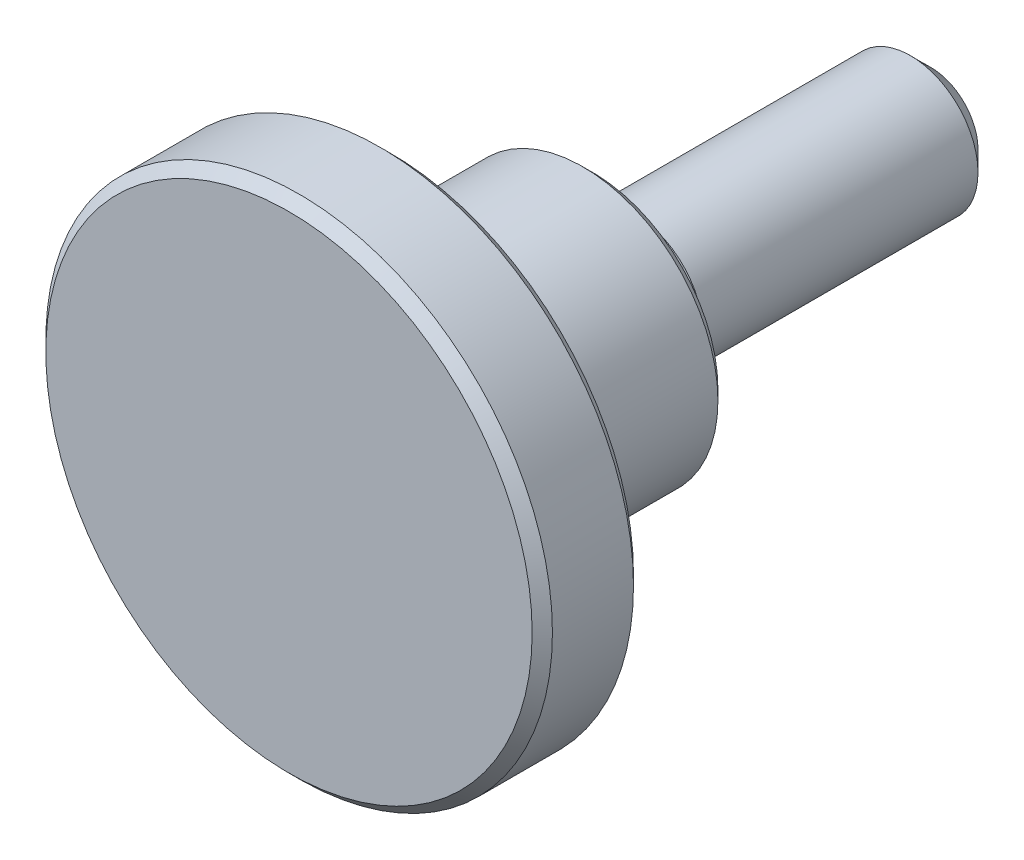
ISO-10303-21;
HEADER;
FILE_DESCRIPTION(('STEP AP214'),'2;1');
FILE_NAME('part.step','',(''),(''),'','','');
FILE_SCHEMA(('AUTOMOTIVE_DESIGN { 1 0 10303 214 1 1 1 1 }'));
ENDSEC;
DATA;
#1=APPLICATION_CONTEXT('core data for automotive mechanical design processes');
#2=APPLICATION_PROTOCOL_DEFINITION('international standard','automotive_design',2000,#1);
#3=PRODUCT_CONTEXT('',#1,'mechanical');
#4=PRODUCT('Part','Part','',(#3));
#5=PRODUCT_RELATED_PRODUCT_CATEGORY('part','',(#4));
#6=PRODUCT_DEFINITION_FORMATION('','',#4);
#7=PRODUCT_DEFINITION_CONTEXT('part definition',#1,'design');
#8=PRODUCT_DEFINITION('design','',#6,#7);
#9=PRODUCT_DEFINITION_SHAPE('','',#8);
#10=(LENGTH_UNIT() NAMED_UNIT(*) SI_UNIT(.MILLI.,.METRE.));
#11=(NAMED_UNIT(*) PLANE_ANGLE_UNIT() SI_UNIT($,.RADIAN.));
#12=(NAMED_UNIT(*) SI_UNIT($,.STERADIAN.) SOLID_ANGLE_UNIT());
#13=UNCERTAINTY_MEASURE_WITH_UNIT(LENGTH_MEASURE(1.E-05),#10,'distance_accuracy_value','');
#14=(GEOMETRIC_REPRESENTATION_CONTEXT(3) GLOBAL_UNCERTAINTY_ASSIGNED_CONTEXT((#13)) GLOBAL_UNIT_ASSIGNED_CONTEXT((#10,
#11,#12)) REPRESENTATION_CONTEXT('',''));
#15=CARTESIAN_POINT('',(0.,0.,0.));
#16=DIRECTION('',(0.,0.,1.));
#17=DIRECTION('',(1.,0.,0.));
#18=AXIS2_PLACEMENT_3D('',#15,#16,#17);
#19=CARTESIAN_POINT('',(0.,2.8,-20.));
#20=DIRECTION('',(0.,0.,1.));
#21=DIRECTION('',(1.,0.,0.));
#22=AXIS2_PLACEMENT_3D('',#19,#20,#21);
#23=PLANE('',#22);
#24=CARTESIAN_POINT('',(0.,0.,-20.));
#25=DIRECTION('',(0.,0.,1.));
#26=DIRECTION('',(1.,0.,0.));
#27=AXIS2_PLACEMENT_3D('',#24,#25,#26);
#28=CIRCLE('',#27,2.8);
#29=CARTESIAN_POINT('',(2.8,0.,-20.));
#30=VERTEX_POINT('',#29);
#31=EDGE_CURVE('E8',#30,#30,#28,.T.);
#32=ORIENTED_EDGE('',*,*,#31,.F.);
#33=EDGE_LOOP('',(#32));
#34=FACE_BOUND('',#33,.T.);
#35=ADVANCED_FACE('F12',(#34),#23,.F.);
#36=CARTESIAN_POINT('',(0.,0.,-20.));
#37=DIRECTION('',(0.,0.,1.));
#38=DIRECTION('',(1.,0.,0.));
#39=AXIS2_PLACEMENT_3D('',#36,#37,#38);
#40=CONICAL_SURFACE('',#39,2.8,0.785398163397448);
#41=CARTESIAN_POINT('',(0.,0.,-18.8));
#42=DIRECTION('',(0.,0.,1.));
#43=DIRECTION('',(1.,0.,0.));
#44=AXIS2_PLACEMENT_3D('',#41,#42,#43);
#45=CIRCLE('',#44,4.);
#46=CARTESIAN_POINT('',(4.,0.,-18.8));
#47=VERTEX_POINT('',#46);
#48=EDGE_CURVE('E18',#47,#47,#45,.T.);
#49=ORIENTED_EDGE('',*,*,#48,.F.);
#50=EDGE_LOOP('',(#49));
#51=FACE_BOUND('',#50,.T.);
#52=ORIENTED_EDGE('',*,*,#31,.T.);
#53=EDGE_LOOP('',(#52));
#54=FACE_BOUND('',#53,.T.);
#55=ADVANCED_FACE('F141',(#51,#54),#40,.T.);
#56=CARTESIAN_POINT('',(0.,0.,23.));
#57=DIRECTION('',(0.,0.,1.));
#58=DIRECTION('',(1.,0.,0.));
#59=AXIS2_PLACEMENT_3D('',#56,#57,#58);
#60=CYLINDRICAL_SURFACE('',#59,4.);
#61=CARTESIAN_POINT('',(0.,0.,-2.5));
#62=DIRECTION('',(0.,0.,1.));
#63=DIRECTION('',(1.,0.,0.));
#64=AXIS2_PLACEMENT_3D('',#61,#62,#63);
#65=CIRCLE('',#64,4.);
#66=CARTESIAN_POINT('',(4.,0.,-2.5));
#67=VERTEX_POINT('',#66);
#68=EDGE_CURVE('E22',#67,#67,#65,.T.);
#69=ORIENTED_EDGE('',*,*,#68,.F.);
#70=EDGE_LOOP('',(#69));
#71=FACE_BOUND('',#70,.T.);
#72=ORIENTED_EDGE('',*,*,#48,.T.);
#73=EDGE_LOOP('',(#72));
#74=FACE_BOUND('',#73,.T.);
#75=ADVANCED_FACE('F136',(#71,#74),#60,.T.);
#76=CARTESIAN_POINT('',(0.,4.,-2.5));
#77=DIRECTION('',(0.,0.,-1.));
#78=DIRECTION('',(-1.,0.,0.));
#79=AXIS2_PLACEMENT_3D('',#76,#77,#78);
#80=PLANE('',#79);
#81=CARTESIAN_POINT('',(0.,0.,-2.5));
#82=DIRECTION('',(0.,0.,1.));
#83=DIRECTION('',(1.,0.,0.));
#84=AXIS2_PLACEMENT_3D('',#81,#82,#83);
#85=CIRCLE('',#84,3.6);
#86=CARTESIAN_POINT('',(3.6,0.,-2.5));
#87=VERTEX_POINT('',#86);
#88=EDGE_CURVE('E26',#87,#87,#85,.T.);
#89=ORIENTED_EDGE('',*,*,#88,.F.);
#90=EDGE_LOOP('',(#89));
#91=FACE_BOUND('',#90,.T.);
#92=ORIENTED_EDGE('',*,*,#68,.T.);
#93=EDGE_LOOP('',(#92));
#94=FACE_BOUND('',#93,.T.);
#95=ADVANCED_FACE('F130',(#91,#94),#80,.F.);
#96=CARTESIAN_POINT('',(0.,0.,-1.9));
#97=DIRECTION('',(0.,0.,1.));
#98=DIRECTION('',(1.,0.,0.));
#99=AXIS2_PLACEMENT_3D('',#96,#97,#98);
#100=TOROIDAL_SURFACE('',#99,3.6,0.6);
#101=CARTESIAN_POINT('',(0.,0.,-1.9));
#102=DIRECTION('',(0.,0.,1.));
#103=DIRECTION('',(1.,0.,0.));
#104=AXIS2_PLACEMENT_3D('',#101,#102,#103);
#105=CIRCLE('',#104,3.);
#106=CARTESIAN_POINT('',(3.,0.,-1.9));
#107=VERTEX_POINT('',#106);
#108=EDGE_CURVE('E31',#107,#107,#105,.T.);
#109=ORIENTED_EDGE('',*,*,#108,.F.);
#110=EDGE_LOOP('',(#109));
#111=FACE_BOUND('',#110,.T.);
#112=ORIENTED_EDGE('',*,*,#88,.T.);
#113=EDGE_LOOP('',(#112));
#114=FACE_BOUND('',#113,.T.);
#115=ADVANCED_FACE('F124',(#111,#114),#100,.F.);
#116=CARTESIAN_POINT('',(0.,0.,23.));
#117=DIRECTION('',(0.,0.,1.));
#118=DIRECTION('',(1.,0.,0.));
#119=AXIS2_PLACEMENT_3D('',#116,#117,#118);
#120=CYLINDRICAL_SURFACE('',#119,3.);
#121=CARTESIAN_POINT('',(0.,0.,-0.600000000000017));
#122=DIRECTION('',(0.,0.,1.));
#123=DIRECTION('',(1.,0.,0.));
#124=AXIS2_PLACEMENT_3D('',#121,#122,#123);
#125=CIRCLE('',#124,3.);
#126=CARTESIAN_POINT('',(3.,0.,-0.600000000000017));
#127=VERTEX_POINT('',#126);
#128=EDGE_CURVE('E34',#127,#127,#125,.T.);
#129=ORIENTED_EDGE('',*,*,#128,.F.);
#130=EDGE_LOOP('',(#129));
#131=FACE_BOUND('',#130,.T.);
#132=ORIENTED_EDGE('',*,*,#108,.T.);
#133=EDGE_LOOP('',(#132));
#134=FACE_BOUND('',#133,.T.);
#135=ADVANCED_FACE('F118',(#131,#134),#120,.T.);
#136=CARTESIAN_POINT('',(0.,0.,-0.600000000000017));
#137=DIRECTION('',(0.,0.,1.));
#138=DIRECTION('',(1.,0.,0.));
#139=AXIS2_PLACEMENT_3D('',#136,#137,#138);
#140=TOROIDAL_SURFACE('',#139,3.6,0.600000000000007);
#141=CARTESIAN_POINT('',(0.,0.,0.));
#142=DIRECTION('',(0.,0.,1.));
#143=DIRECTION('',(1.,0.,0.));
#144=AXIS2_PLACEMENT_3D('',#141,#142,#143);
#145=CIRCLE('',#144,3.60000000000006);
#146=CARTESIAN_POINT('',(3.60000000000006,0.,0.));
#147=VERTEX_POINT('',#146);
#148=EDGE_CURVE('E37',#147,#147,#145,.T.);
#149=ORIENTED_EDGE('',*,*,#148,.F.);
#150=EDGE_LOOP('',(#149));
#151=FACE_BOUND('',#150,.T.);
#152=ORIENTED_EDGE('',*,*,#128,.T.);
#153=EDGE_LOOP('',(#152));
#154=FACE_BOUND('',#153,.T.);
#155=ADVANCED_FACE('F112',(#151,#154),#140,.F.);
#156=CARTESIAN_POINT('',(0.,7.4,0.));
#157=DIRECTION('',(0.,0.,1.));
#158=DIRECTION('',(1.,0.,0.));
#159=AXIS2_PLACEMENT_3D('',#156,#157,#158);
#160=PLANE('',#159);
#161=CARTESIAN_POINT('',(0.,0.,0.));
#162=DIRECTION('',(0.,0.,1.));
#163=DIRECTION('',(1.,0.,0.));
#164=AXIS2_PLACEMENT_3D('',#161,#162,#163);
#165=CIRCLE('',#164,7.4);
#166=CARTESIAN_POINT('',(7.4,0.,0.));
#167=VERTEX_POINT('',#166);
#168=EDGE_CURVE('E40',#167,#167,#165,.T.);
#169=ORIENTED_EDGE('',*,*,#168,.F.);
#170=EDGE_LOOP('',(#169));
#171=FACE_BOUND('',#170,.T.);
#172=ORIENTED_EDGE('',*,*,#148,.T.);
#173=EDGE_LOOP('',(#172));
#174=FACE_BOUND('',#173,.T.);
#175=ADVANCED_FACE('F106',(#171,#174),#160,.F.);
#176=CARTESIAN_POINT('',(0.,0.,0.));
#177=DIRECTION('',(0.,0.,1.));
#178=DIRECTION('',(1.,0.,0.));
#179=AXIS2_PLACEMENT_3D('',#176,#177,#178);
#180=CONICAL_SURFACE('',#179,7.4,0.78539816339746);
#181=CARTESIAN_POINT('',(0.,0.,0.599999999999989));
#182=DIRECTION('',(0.,0.,1.));
#183=DIRECTION('',(1.,0.,0.));
#184=AXIS2_PLACEMENT_3D('',#181,#182,#183);
#185=CIRCLE('',#184,8.);
#186=CARTESIAN_POINT('',(8.,0.,0.599999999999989));
#187=VERTEX_POINT('',#186);
#188=EDGE_CURVE('E43',#187,#187,#185,.T.);
#189=ORIENTED_EDGE('',*,*,#188,.F.);
#190=EDGE_LOOP('',(#189));
#191=FACE_BOUND('',#190,.T.);
#192=ORIENTED_EDGE('',*,*,#168,.T.);
#193=EDGE_LOOP('',(#192));
#194=FACE_BOUND('',#193,.T.);
#195=ADVANCED_FACE('F100',(#191,#194),#180,.T.);
#196=CARTESIAN_POINT('',(0.,0.,23.));
#197=DIRECTION('',(0.,0.,1.));
#198=DIRECTION('',(1.,0.,0.));
#199=AXIS2_PLACEMENT_3D('',#196,#197,#198);
#200=CYLINDRICAL_SURFACE('',#199,8.);
#201=CARTESIAN_POINT('',(0.,0.,10.));
#202=DIRECTION('',(0.,0.,1.));
#203=DIRECTION('',(1.,0.,0.));
#204=AXIS2_PLACEMENT_3D('',#201,#202,#203);
#205=CIRCLE('',#204,8.);
#206=CARTESIAN_POINT('',(8.,0.,10.));
#207=VERTEX_POINT('',#206);
#208=EDGE_CURVE('E46',#207,#207,#205,.T.);
#209=ORIENTED_EDGE('',*,*,#208,.F.);
#210=EDGE_LOOP('',(#209));
#211=FACE_BOUND('',#210,.T.);
#212=ORIENTED_EDGE('',*,*,#188,.T.);
#213=EDGE_LOOP('',(#212));
#214=FACE_BOUND('',#213,.T.);
#215=ADVANCED_FACE('F94',(#211,#214),#200,.T.);
#216=CARTESIAN_POINT('',(0.,0.,10.));
#217=DIRECTION('',(0.,0.,1.));
#218=DIRECTION('',(1.,0.,0.));
#219=AXIS2_PLACEMENT_3D('',#216,#217,#218);
#220=TOROIDAL_SURFACE('',#219,10.,2.);
#221=CARTESIAN_POINT('',(0.,0.,12.));
#222=DIRECTION('',(0.,0.,1.));
#223=DIRECTION('',(1.,0.,0.));
#224=AXIS2_PLACEMENT_3D('',#221,#222,#223);
#225=CIRCLE('',#224,10.);
#226=CARTESIAN_POINT('',(10.,0.,12.));
#227=VERTEX_POINT('',#226);
#228=EDGE_CURVE('E49',#227,#227,#225,.T.);
#229=ORIENTED_EDGE('',*,*,#228,.F.);
#230=EDGE_LOOP('',(#229));
#231=FACE_BOUND('',#230,.T.);
#232=ORIENTED_EDGE('',*,*,#208,.T.);
#233=EDGE_LOOP('',(#232));
#234=FACE_BOUND('',#233,.T.);
#235=ADVANCED_FACE('F88',(#231,#234),#220,.F.);
#236=CARTESIAN_POINT('',(0.,14.4,12.));
#237=DIRECTION('',(0.,0.,1.));
#238=DIRECTION('',(1.,0.,0.));
#239=AXIS2_PLACEMENT_3D('',#236,#237,#238);
#240=PLANE('',#239);
#241=CARTESIAN_POINT('',(0.,0.,12.));
#242=DIRECTION('',(0.,0.,1.));
#243=DIRECTION('',(1.,0.,0.));
#244=AXIS2_PLACEMENT_3D('',#241,#242,#243);
#245=CIRCLE('',#244,14.4);
#246=CARTESIAN_POINT('',(14.4,0.,12.));
#247=VERTEX_POINT('',#246);
#248=EDGE_CURVE('E52',#247,#247,#245,.T.);
#249=ORIENTED_EDGE('',*,*,#248,.F.);
#250=EDGE_LOOP('',(#249));
#251=FACE_BOUND('',#250,.T.);
#252=ORIENTED_EDGE('',*,*,#228,.T.);
#253=EDGE_LOOP('',(#252));
#254=FACE_BOUND('',#253,.T.);
#255=ADVANCED_FACE('F82',(#251,#254),#240,.F.);
#256=CARTESIAN_POINT('',(0.,0.,12.));
#257=DIRECTION('',(0.,0.,1.));
#258=DIRECTION('',(1.,0.,0.));
#259=AXIS2_PLACEMENT_3D('',#256,#257,#258);
#260=CONICAL_SURFACE('',#259,14.4,0.785398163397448);
#261=CARTESIAN_POINT('',(0.,0.,12.6));
#262=DIRECTION('',(0.,0.,1.));
#263=DIRECTION('',(1.,0.,0.));
#264=AXIS2_PLACEMENT_3D('',#261,#262,#263);
#265=CIRCLE('',#264,15.);
#266=CARTESIAN_POINT('',(15.,0.,12.6));
#267=VERTEX_POINT('',#266);
#268=EDGE_CURVE('E55',#267,#267,#265,.T.);
#269=ORIENTED_EDGE('',*,*,#268,.F.);
#270=EDGE_LOOP('',(#269));
#271=FACE_BOUND('',#270,.T.);
#272=ORIENTED_EDGE('',*,*,#248,.T.);
#273=EDGE_LOOP('',(#272));
#274=FACE_BOUND('',#273,.T.);
#275=ADVANCED_FACE('F76',(#271,#274),#260,.T.);
#276=CARTESIAN_POINT('',(0.,0.,23.));
#277=DIRECTION('',(0.,0.,1.));
#278=DIRECTION('',(1.,0.,0.));
#279=AXIS2_PLACEMENT_3D('',#276,#277,#278);
#280=CYLINDRICAL_SURFACE('',#279,15.);
#281=CARTESIAN_POINT('',(0.,0.,17.4));
#282=DIRECTION('',(0.,0.,1.));
#283=DIRECTION('',(1.,0.,0.));
#284=AXIS2_PLACEMENT_3D('',#281,#282,#283);
#285=CIRCLE('',#284,15.);
#286=CARTESIAN_POINT('',(15.,0.,17.4));
#287=VERTEX_POINT('',#286);
#288=EDGE_CURVE('E58',#287,#287,#285,.T.);
#289=ORIENTED_EDGE('',*,*,#288,.F.);
#290=EDGE_LOOP('',(#289));
#291=FACE_BOUND('',#290,.T.);
#292=ORIENTED_EDGE('',*,*,#268,.T.);
#293=EDGE_LOOP('',(#292));
#294=FACE_BOUND('',#293,.T.);
#295=ADVANCED_FACE('F70',(#291,#294),#280,.T.);
#296=CARTESIAN_POINT('',(0.,0.,17.4));
#297=DIRECTION('',(0.,0.,-1.));
#298=DIRECTION('',(-1.,0.,0.));
#299=AXIS2_PLACEMENT_3D('',#296,#297,#298);
#300=CONICAL_SURFACE('',#299,15.,0.785398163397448);
#301=CARTESIAN_POINT('',(0.,0.,18.));
#302=DIRECTION('',(0.,0.,1.));
#303=DIRECTION('',(1.,0.,0.));
#304=AXIS2_PLACEMENT_3D('',#301,#302,#303);
#305=CIRCLE('',#304,14.4);
#306=CARTESIAN_POINT('',(14.4,0.,18.));
#307=VERTEX_POINT('',#306);
#308=EDGE_CURVE('E61',#307,#307,#305,.T.);
#309=ORIENTED_EDGE('',*,*,#308,.F.);
#310=EDGE_LOOP('',(#309));
#311=FACE_BOUND('',#310,.T.);
#312=ORIENTED_EDGE('',*,*,#288,.T.);
#313=EDGE_LOOP('',(#312));
#314=FACE_BOUND('',#313,.T.);
#315=ADVANCED_FACE('F67',(#311,#314),#300,.T.);
#316=CARTESIAN_POINT('',(0.,14.4,18.));
#317=DIRECTION('',(0.,0.,-1.));
#318=DIRECTION('',(-1.,0.,0.));
#319=AXIS2_PLACEMENT_3D('',#316,#317,#318);
#320=PLANE('',#319);
#321=ORIENTED_EDGE('',*,*,#308,.T.);
#322=EDGE_LOOP('',(#321));
#323=FACE_BOUND('',#322,.T.);
#324=ADVANCED_FACE('F65',(#323),#320,.F.);
#325=CLOSED_SHELL('',(#35,#55,#75,#95,#115,#135,#155,#175,#195,#215,#235,#255,#275,#295,#315,#324));
#326=MANIFOLD_SOLID_BREP('B1',#325);
#327=ADVANCED_BREP_SHAPE_REPRESENTATION('',(#18,#326),#14);
#328=SHAPE_DEFINITION_REPRESENTATION(#9,#327);
ENDSEC;
END-ISO-10303-21;
